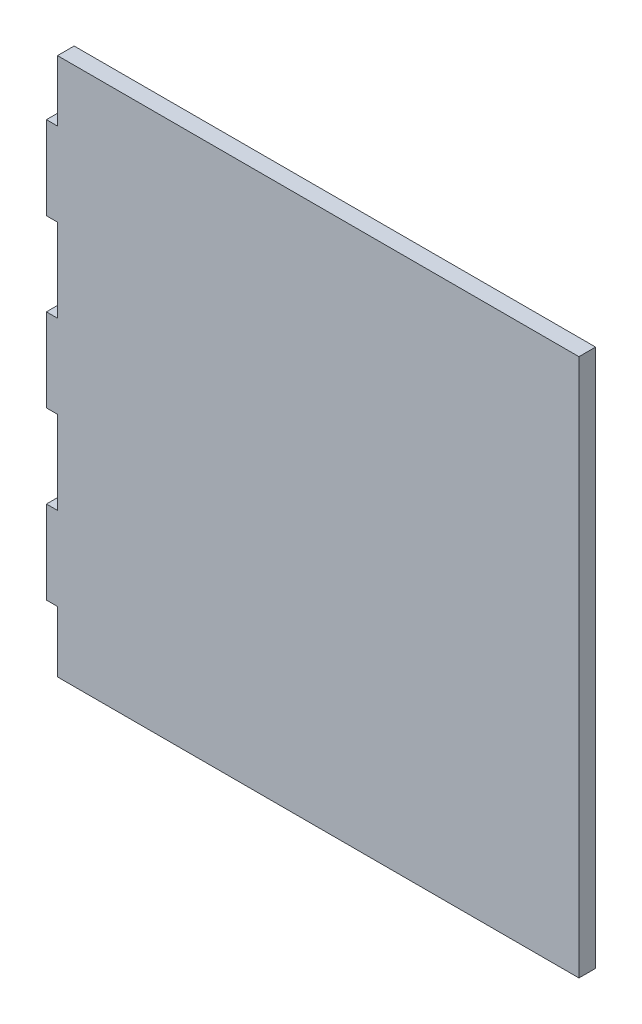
ISO-10303-21;
HEADER;
FILE_DESCRIPTION(('STEP AP214'),'2;1');
FILE_NAME('part.step','',(''),(''),'','','');
FILE_SCHEMA(('AUTOMOTIVE_DESIGN { 1 0 10303 214 1 1 1 1 }'));
ENDSEC;
DATA;
#1=APPLICATION_CONTEXT('core data for automotive mechanical design processes');
#2=APPLICATION_PROTOCOL_DEFINITION('international standard','automotive_design',2000,#1);
#3=PRODUCT_CONTEXT('',#1,'mechanical');
#4=PRODUCT('Part','Part','',(#3));
#5=PRODUCT_RELATED_PRODUCT_CATEGORY('part','',(#4));
#6=PRODUCT_DEFINITION_FORMATION('','',#4);
#7=PRODUCT_DEFINITION_CONTEXT('part definition',#1,'design');
#8=PRODUCT_DEFINITION('design','',#6,#7);
#9=PRODUCT_DEFINITION_SHAPE('','',#8);
#10=(LENGTH_UNIT() NAMED_UNIT(*) SI_UNIT(.MILLI.,.METRE.));
#11=(NAMED_UNIT(*) PLANE_ANGLE_UNIT() SI_UNIT($,.RADIAN.));
#12=(NAMED_UNIT(*) SI_UNIT($,.STERADIAN.) SOLID_ANGLE_UNIT());
#13=UNCERTAINTY_MEASURE_WITH_UNIT(LENGTH_MEASURE(1.E-05),#10,'distance_accuracy_value','');
#14=(GEOMETRIC_REPRESENTATION_CONTEXT(3) GLOBAL_UNCERTAINTY_ASSIGNED_CONTEXT((#13)) GLOBAL_UNIT_ASSIGNED_CONTEXT((#10,
#11,#12)) REPRESENTATION_CONTEXT('',''));
#15=CARTESIAN_POINT('',(0.,0.,0.));
#16=DIRECTION('',(0.,0.,1.));
#17=DIRECTION('',(1.,0.,0.));
#18=AXIS2_PLACEMENT_3D('',#15,#16,#17);
#19=CARTESIAN_POINT('',(0.,0.,6.));
#20=DIRECTION('',(1.,0.,0.));
#21=DIRECTION('',(0.,0.,-1.));
#22=AXIS2_PLACEMENT_3D('',#19,#20,#21);
#23=PLANE('',#22);
#24=DIRECTION('',(0.,0.,-1.));
#25=VECTOR('',#24,1.);
#26=CARTESIAN_POINT('',(0.,-82.,6.));
#27=LINE('',#26,#25);
#28=CARTESIAN_POINT('',(0.,-82.,6.));
#29=VERTEX_POINT('',#28);
#30=CARTESIAN_POINT('',(0.,-82.,0.));
#31=VERTEX_POINT('',#30);
#32=EDGE_CURVE('E12',#29,#31,#27,.T.);
#33=ORIENTED_EDGE('',*,*,#32,.F.);
#34=DIRECTION('',(0.,-1.,0.));
#35=VECTOR('',#34,1.);
#36=CARTESIAN_POINT('',(0.,0.,6.));
#37=LINE('',#36,#35);
#38=CARTESIAN_POINT('',(0.,-52.,6.));
#39=VERTEX_POINT('',#38);
#40=EDGE_CURVE('E232',#39,#29,#37,.T.);
#41=ORIENTED_EDGE('',*,*,#40,.F.);
#42=DIRECTION('',(0.,0.,-1.));
#43=VECTOR('',#42,1.);
#44=CARTESIAN_POINT('',(0.,-52.,6.));
#45=LINE('',#44,#43);
#46=CARTESIAN_POINT('',(0.,-52.,0.));
#47=VERTEX_POINT('',#46);
#48=EDGE_CURVE('E166',#39,#47,#45,.T.);
#49=ORIENTED_EDGE('',*,*,#48,.T.);
#50=DIRECTION('',(0.,-1.,0.));
#51=VECTOR('',#50,1.);
#52=CARTESIAN_POINT('',(0.,0.,0.));
#53=LINE('',#52,#51);
#54=EDGE_CURVE('E202',#47,#31,#53,.T.);
#55=ORIENTED_EDGE('',*,*,#54,.T.);
#56=EDGE_LOOP('',(#33,#41,#49,#55));
#57=FACE_BOUND('',#56,.T.);
#58=ADVANCED_FACE('F84',(#57),#23,.F.);
#59=CARTESIAN_POINT('',(188.,0.,6.));
#60=DIRECTION('',(1.,0.,0.));
#61=DIRECTION('',(0.,1.,0.));
#62=AXIS2_PLACEMENT_3D('',#59,#60,#61);
#63=PLANE('',#62);
#64=DIRECTION('',(0.,-1.,0.));
#65=VECTOR('',#64,1.);
#66=CARTESIAN_POINT('',(188.,0.,0.));
#67=LINE('',#66,#65);
#68=CARTESIAN_POINT('',(188.,0.,0.));
#69=VERTEX_POINT('',#68);
#70=CARTESIAN_POINT('',(188.,-194.,0.));
#71=VERTEX_POINT('',#70);
#72=EDGE_CURVE('E218',#69,#71,#67,.T.);
#73=ORIENTED_EDGE('',*,*,#72,.F.);
#74=DIRECTION('',(0.,0.,-1.));
#75=VECTOR('',#74,1.);
#76=CARTESIAN_POINT('',(188.,0.,6.));
#77=LINE('',#76,#75);
#78=CARTESIAN_POINT('',(188.,0.,6.));
#79=VERTEX_POINT('',#78);
#80=EDGE_CURVE('E151',#79,#69,#77,.T.);
#81=ORIENTED_EDGE('',*,*,#80,.F.);
#82=DIRECTION('',(0.,-1.,0.));
#83=VECTOR('',#82,1.);
#84=CARTESIAN_POINT('',(188.,0.,6.));
#85=LINE('',#84,#83);
#86=CARTESIAN_POINT('',(188.,-194.,6.));
#87=VERTEX_POINT('',#86);
#88=EDGE_CURVE('E191',#79,#87,#85,.T.);
#89=ORIENTED_EDGE('',*,*,#88,.T.);
#90=DIRECTION('',(0.,0.,-1.));
#91=VECTOR('',#90,1.);
#92=CARTESIAN_POINT('',(188.,-194.,6.));
#93=LINE('',#92,#91);
#94=EDGE_CURVE('E184',#87,#71,#93,.T.);
#95=ORIENTED_EDGE('',*,*,#94,.T.);
#96=EDGE_LOOP('',(#73,#81,#89,#95));
#97=FACE_BOUND('',#96,.T.);
#98=ADVANCED_FACE('F255',(#97),#63,.T.);
#99=CARTESIAN_POINT('',(0.,0.,6.));
#100=DIRECTION('',(0.,1.,0.));
#101=DIRECTION('',(0.,0.,1.));
#102=AXIS2_PLACEMENT_3D('',#99,#100,#101);
#103=PLANE('',#102);
#104=DIRECTION('',(1.,0.,0.));
#105=VECTOR('',#104,1.);
#106=CARTESIAN_POINT('',(0.,0.,0.));
#107=LINE('',#106,#105);
#108=CARTESIAN_POINT('',(0.,0.,0.));
#109=VERTEX_POINT('',#108);
#110=EDGE_CURVE('E215',#109,#69,#107,.T.);
#111=ORIENTED_EDGE('',*,*,#110,.F.);
#112=DIRECTION('',(0.,0.,-1.));
#113=VECTOR('',#112,1.);
#114=CARTESIAN_POINT('',(0.,0.,6.));
#115=LINE('',#114,#113);
#116=CARTESIAN_POINT('',(0.,0.,6.));
#117=VERTEX_POINT('',#116);
#118=EDGE_CURVE('E154',#117,#109,#115,.T.);
#119=ORIENTED_EDGE('',*,*,#118,.F.);
#120=DIRECTION('',(1.,0.,0.));
#121=VECTOR('',#120,1.);
#122=CARTESIAN_POINT('',(0.,0.,6.));
#123=LINE('',#122,#121);
#124=EDGE_CURVE('E246',#117,#79,#123,.T.);
#125=ORIENTED_EDGE('',*,*,#124,.T.);
#126=ORIENTED_EDGE('',*,*,#80,.T.);
#127=EDGE_LOOP('',(#111,#119,#125,#126));
#128=FACE_BOUND('',#127,.T.);
#129=ADVANCED_FACE('F272',(#128),#103,.T.);
#130=CARTESIAN_POINT('',(0.,-22.,0.));
#131=VERTEX_POINT('',#130);
#132=EDGE_CURVE('E212',#109,#131,#53,.T.);
#133=ORIENTED_EDGE('',*,*,#132,.T.);
#134=DIRECTION('',(0.,0.,-1.));
#135=VECTOR('',#134,1.);
#136=CARTESIAN_POINT('',(0.,-22.,6.));
#137=LINE('',#136,#135);
#138=CARTESIAN_POINT('',(0.,-22.,6.));
#139=VERTEX_POINT('',#138);
#140=EDGE_CURVE('E157',#139,#131,#137,.T.);
#141=ORIENTED_EDGE('',*,*,#140,.F.);
#142=EDGE_CURVE('E243',#117,#139,#37,.T.);
#143=ORIENTED_EDGE('',*,*,#142,.F.);
#144=ORIENTED_EDGE('',*,*,#118,.T.);
#145=EDGE_LOOP('',(#133,#141,#143,#144));
#146=FACE_BOUND('',#145,.T.);
#147=ADVANCED_FACE('F280',(#146),#23,.F.);
#148=CARTESIAN_POINT('',(0.,-22.,6.));
#149=DIRECTION('',(0.,-1.,0.));
#150=DIRECTION('',(0.,0.,-1.));
#151=AXIS2_PLACEMENT_3D('',#148,#149,#150);
#152=PLANE('',#151);
#153=DIRECTION('',(-1.,0.,0.));
#154=VECTOR('',#153,1.);
#155=CARTESIAN_POINT('',(0.,-22.,0.));
#156=LINE('',#155,#154);
#157=CARTESIAN_POINT('',(-4.,-22.,0.));
#158=VERTEX_POINT('',#157);
#159=EDGE_CURVE('E209',#131,#158,#156,.T.);
#160=ORIENTED_EDGE('',*,*,#159,.T.);
#161=DIRECTION('',(0.,0.,-1.));
#162=VECTOR('',#161,1.);
#163=CARTESIAN_POINT('',(-4.,-22.,6.));
#164=LINE('',#163,#162);
#165=CARTESIAN_POINT('',(-4.,-22.,6.));
#166=VERTEX_POINT('',#165);
#167=EDGE_CURVE('E160',#166,#158,#164,.T.);
#168=ORIENTED_EDGE('',*,*,#167,.F.);
#169=DIRECTION('',(-1.,0.,0.));
#170=VECTOR('',#169,1.);
#171=CARTESIAN_POINT('',(0.,-22.,6.));
#172=LINE('',#171,#170);
#173=EDGE_CURVE('E240',#139,#166,#172,.T.);
#174=ORIENTED_EDGE('',*,*,#173,.F.);
#175=ORIENTED_EDGE('',*,*,#140,.T.);
#176=EDGE_LOOP('',(#160,#168,#174,#175));
#177=FACE_BOUND('',#176,.T.);
#178=ADVANCED_FACE('F343',(#177),#152,.F.);
#179=CARTESIAN_POINT('',(-4.,0.,6.));
#180=DIRECTION('',(1.,0.,0.));
#181=DIRECTION('',(0.,0.,-1.));
#182=AXIS2_PLACEMENT_3D('',#179,#180,#181);
#183=PLANE('',#182);
#184=DIRECTION('',(0.,-1.,0.));
#185=VECTOR('',#184,1.);
#186=CARTESIAN_POINT('',(-4.,0.,0.));
#187=LINE('',#186,#185);
#188=CARTESIAN_POINT('',(-4.,-52.,0.));
#189=VERTEX_POINT('',#188);
#190=EDGE_CURVE('E206',#158,#189,#187,.T.);
#191=ORIENTED_EDGE('',*,*,#190,.T.);
#192=DIRECTION('',(0.,0.,-1.));
#193=VECTOR('',#192,1.);
#194=CARTESIAN_POINT('',(-4.,-52.,6.));
#195=LINE('',#194,#193);
#196=CARTESIAN_POINT('',(-4.,-52.,6.));
#197=VERTEX_POINT('',#196);
#198=EDGE_CURVE('E163',#197,#189,#195,.T.);
#199=ORIENTED_EDGE('',*,*,#198,.F.);
#200=DIRECTION('',(0.,-1.,0.));
#201=VECTOR('',#200,1.);
#202=CARTESIAN_POINT('',(-4.,0.,6.));
#203=LINE('',#202,#201);
#204=EDGE_CURVE('E237',#166,#197,#203,.T.);
#205=ORIENTED_EDGE('',*,*,#204,.F.);
#206=ORIENTED_EDGE('',*,*,#167,.T.);
#207=EDGE_LOOP('',(#191,#199,#205,#206));
#208=FACE_BOUND('',#207,.T.);
#209=ADVANCED_FACE('F347',(#208),#183,.F.);
#210=CARTESIAN_POINT('',(0.,-52.,6.));
#211=DIRECTION('',(0.,-1.,0.));
#212=DIRECTION('',(0.,0.,-1.));
#213=AXIS2_PLACEMENT_3D('',#210,#211,#212);
#214=PLANE('',#213);
#215=DIRECTION('',(-1.,0.,0.));
#216=VECTOR('',#215,1.);
#217=CARTESIAN_POINT('',(0.,-52.,0.));
#218=LINE('',#217,#216);
#219=EDGE_CURVE('E203',#47,#189,#218,.T.);
#220=ORIENTED_EDGE('',*,*,#219,.F.);
#221=ORIENTED_EDGE('',*,*,#48,.F.);
#222=DIRECTION('',(-1.,0.,0.));
#223=VECTOR('',#222,1.);
#224=CARTESIAN_POINT('',(0.,-52.,6.));
#225=LINE('',#224,#223);
#226=EDGE_CURVE('E233',#39,#197,#225,.T.);
#227=ORIENTED_EDGE('',*,*,#226,.T.);
#228=ORIENTED_EDGE('',*,*,#198,.T.);
#229=EDGE_LOOP('',(#220,#221,#227,#228));
#230=FACE_BOUND('',#229,.T.);
#231=ADVANCED_FACE('F352',(#230),#214,.T.);
#232=CARTESIAN_POINT('',(0.,-112.,6.));
#233=VERTEX_POINT('',#232);
#234=CARTESIAN_POINT('',(0.,-142.,6.));
#235=VERTEX_POINT('',#234);
#236=EDGE_CURVE('E236',#233,#235,#37,.T.);
#237=ORIENTED_EDGE('',*,*,#236,.F.);
#238=DIRECTION('',(0.,0.,-1.));
#239=VECTOR('',#238,1.);
#240=CARTESIAN_POINT('',(0.,-112.,6.));
#241=LINE('',#240,#239);
#242=CARTESIAN_POINT('',(0.,-112.,0.));
#243=VERTEX_POINT('',#242);
#244=EDGE_CURVE('E94',#233,#243,#241,.T.);
#245=ORIENTED_EDGE('',*,*,#244,.T.);
#246=CARTESIAN_POINT('',(0.,-142.,0.));
#247=VERTEX_POINT('',#246);
#248=EDGE_CURVE('E140',#243,#247,#53,.T.);
#249=ORIENTED_EDGE('',*,*,#248,.T.);
#250=DIRECTION('',(0.,0.,-1.));
#251=VECTOR('',#250,1.);
#252=CARTESIAN_POINT('',(0.,-142.,6.));
#253=LINE('',#252,#251);
#254=EDGE_CURVE('E169',#235,#247,#253,.T.);
#255=ORIENTED_EDGE('',*,*,#254,.F.);
#256=EDGE_LOOP('',(#237,#245,#249,#255));
#257=FACE_BOUND('',#256,.T.);
#258=ADVANCED_FACE('F327',(#257),#23,.F.);
#259=CARTESIAN_POINT('',(0.,-142.,6.));
#260=DIRECTION('',(0.,-1.,0.));
#261=DIRECTION('',(0.,0.,-1.));
#262=AXIS2_PLACEMENT_3D('',#259,#260,#261);
#263=PLANE('',#262);
#264=DIRECTION('',(-1.,0.,0.));
#265=VECTOR('',#264,1.);
#266=CARTESIAN_POINT('',(0.,-142.,0.));
#267=LINE('',#266,#265);
#268=CARTESIAN_POINT('',(-4.,-142.,0.));
#269=VERTEX_POINT('',#268);
#270=EDGE_CURVE('E199',#247,#269,#267,.T.);
#271=ORIENTED_EDGE('',*,*,#270,.T.);
#272=DIRECTION('',(0.,0.,-1.));
#273=VECTOR('',#272,1.);
#274=CARTESIAN_POINT('',(-4.,-142.,6.));
#275=LINE('',#274,#273);
#276=CARTESIAN_POINT('',(-4.,-142.,6.));
#277=VERTEX_POINT('',#276);
#278=EDGE_CURVE('E172',#277,#269,#275,.T.);
#279=ORIENTED_EDGE('',*,*,#278,.F.);
#280=DIRECTION('',(-1.,0.,0.));
#281=VECTOR('',#280,1.);
#282=CARTESIAN_POINT('',(0.,-142.,6.));
#283=LINE('',#282,#281);
#284=EDGE_CURVE('E229',#235,#277,#283,.T.);
#285=ORIENTED_EDGE('',*,*,#284,.F.);
#286=ORIENTED_EDGE('',*,*,#254,.T.);
#287=EDGE_LOOP('',(#271,#279,#285,#286));
#288=FACE_BOUND('',#287,.T.);
#289=ADVANCED_FACE('F379',(#288),#263,.F.);
#290=CARTESIAN_POINT('',(-4.,0.,6.));
#291=DIRECTION('',(1.,0.,0.));
#292=DIRECTION('',(0.,0.,-1.));
#293=AXIS2_PLACEMENT_3D('',#290,#291,#292);
#294=PLANE('',#293);
#295=DIRECTION('',(0.,-1.,0.));
#296=VECTOR('',#295,1.);
#297=CARTESIAN_POINT('',(-4.,0.,0.));
#298=LINE('',#297,#296);
#299=CARTESIAN_POINT('',(-4.,-172.,0.));
#300=VERTEX_POINT('',#299);
#301=EDGE_CURVE('E196',#269,#300,#298,.T.);
#302=ORIENTED_EDGE('',*,*,#301,.T.);
#303=DIRECTION('',(0.,0.,-1.));
#304=VECTOR('',#303,1.);
#305=CARTESIAN_POINT('',(-4.,-172.,6.));
#306=LINE('',#305,#304);
#307=CARTESIAN_POINT('',(-4.,-172.,6.));
#308=VERTEX_POINT('',#307);
#309=EDGE_CURVE('E175',#308,#300,#306,.T.);
#310=ORIENTED_EDGE('',*,*,#309,.F.);
#311=DIRECTION('',(0.,-1.,0.));
#312=VECTOR('',#311,1.);
#313=CARTESIAN_POINT('',(-4.,0.,6.));
#314=LINE('',#313,#312);
#315=EDGE_CURVE('E226',#277,#308,#314,.T.);
#316=ORIENTED_EDGE('',*,*,#315,.F.);
#317=ORIENTED_EDGE('',*,*,#278,.T.);
#318=EDGE_LOOP('',(#302,#310,#316,#317));
#319=FACE_BOUND('',#318,.T.);
#320=ADVANCED_FACE('F382',(#319),#294,.F.);
#321=CARTESIAN_POINT('',(0.,-172.,6.));
#322=DIRECTION('',(0.,-1.,0.));
#323=DIRECTION('',(0.,0.,-1.));
#324=AXIS2_PLACEMENT_3D('',#321,#322,#323);
#325=PLANE('',#324);
#326=DIRECTION('',(-1.,0.,0.));
#327=VECTOR('',#326,1.);
#328=CARTESIAN_POINT('',(0.,-172.,0.));
#329=LINE('',#328,#327);
#330=CARTESIAN_POINT('',(0.,-172.,0.));
#331=VERTEX_POINT('',#330);
#332=EDGE_CURVE('E193',#331,#300,#329,.T.);
#333=ORIENTED_EDGE('',*,*,#332,.F.);
#334=DIRECTION('',(0.,0.,-1.));
#335=VECTOR('',#334,1.);
#336=CARTESIAN_POINT('',(0.,-172.,6.));
#337=LINE('',#336,#335);
#338=CARTESIAN_POINT('',(0.,-172.,6.));
#339=VERTEX_POINT('',#338);
#340=EDGE_CURVE('E178',#339,#331,#337,.T.);
#341=ORIENTED_EDGE('',*,*,#340,.F.);
#342=DIRECTION('',(-1.,0.,0.));
#343=VECTOR('',#342,1.);
#344=CARTESIAN_POINT('',(0.,-172.,6.));
#345=LINE('',#344,#343);
#346=EDGE_CURVE('E223',#339,#308,#345,.T.);
#347=ORIENTED_EDGE('',*,*,#346,.T.);
#348=ORIENTED_EDGE('',*,*,#309,.T.);
#349=EDGE_LOOP('',(#333,#341,#347,#348));
#350=FACE_BOUND('',#349,.T.);
#351=ADVANCED_FACE('F386',(#350),#325,.T.);
#352=CARTESIAN_POINT('',(0.,-194.,0.));
#353=VERTEX_POINT('',#352);
#354=EDGE_CURVE('E192',#331,#353,#53,.T.);
#355=ORIENTED_EDGE('',*,*,#354,.T.);
#356=DIRECTION('',(0.,0.,-1.));
#357=VECTOR('',#356,1.);
#358=CARTESIAN_POINT('',(0.,-194.,6.));
#359=LINE('',#358,#357);
#360=CARTESIAN_POINT('',(0.,-194.,6.));
#361=VERTEX_POINT('',#360);
#362=EDGE_CURVE('E181',#361,#353,#359,.T.);
#363=ORIENTED_EDGE('',*,*,#362,.F.);
#364=EDGE_CURVE('E222',#339,#361,#37,.T.);
#365=ORIENTED_EDGE('',*,*,#364,.F.);
#366=ORIENTED_EDGE('',*,*,#340,.T.);
#367=EDGE_LOOP('',(#355,#363,#365,#366));
#368=FACE_BOUND('',#367,.T.);
#369=ADVANCED_FACE('F335',(#368),#23,.F.);
#370=CARTESIAN_POINT('',(0.,-194.,6.));
#371=DIRECTION('',(0.,1.,0.));
#372=DIRECTION('',(0.,0.,1.));
#373=AXIS2_PLACEMENT_3D('',#370,#371,#372);
#374=PLANE('',#373);
#375=DIRECTION('',(1.,0.,0.));
#376=VECTOR('',#375,1.);
#377=CARTESIAN_POINT('',(0.,-194.,0.));
#378=LINE('',#377,#376);
#379=EDGE_CURVE('E188',#353,#71,#378,.T.);
#380=ORIENTED_EDGE('',*,*,#379,.T.);
#381=ORIENTED_EDGE('',*,*,#94,.F.);
#382=DIRECTION('',(1.,0.,0.));
#383=VECTOR('',#382,1.);
#384=CARTESIAN_POINT('',(0.,-194.,6.));
#385=LINE('',#384,#383);
#386=EDGE_CURVE('E187',#361,#87,#385,.T.);
#387=ORIENTED_EDGE('',*,*,#386,.F.);
#388=ORIENTED_EDGE('',*,*,#362,.T.);
#389=EDGE_LOOP('',(#380,#381,#387,#388));
#390=FACE_BOUND('',#389,.T.);
#391=ADVANCED_FACE('F339',(#390),#374,.F.);
#392=CARTESIAN_POINT('',(0.,0.,6.));
#393=DIRECTION('',(0.,0.,1.));
#394=DIRECTION('',(1.,0.,0.));
#395=AXIS2_PLACEMENT_3D('',#392,#393,#394);
#396=PLANE('',#395);
#397=ORIENTED_EDGE('',*,*,#88,.F.);
#398=ORIENTED_EDGE('',*,*,#124,.F.);
#399=ORIENTED_EDGE('',*,*,#142,.T.);
#400=ORIENTED_EDGE('',*,*,#173,.T.);
#401=ORIENTED_EDGE('',*,*,#204,.T.);
#402=ORIENTED_EDGE('',*,*,#226,.F.);
#403=ORIENTED_EDGE('',*,*,#40,.T.);
#404=DIRECTION('',(-1.,0.,0.));
#405=VECTOR('',#404,1.);
#406=CARTESIAN_POINT('',(0.,-82.,6.));
#407=LINE('',#406,#405);
#408=CARTESIAN_POINT('',(-4.,-82.,6.));
#409=VERTEX_POINT('',#408);
#410=EDGE_CURVE('E141',#29,#409,#407,.T.);
#411=ORIENTED_EDGE('',*,*,#410,.T.);
#412=DIRECTION('',(0.,-1.,0.));
#413=VECTOR('',#412,1.);
#414=CARTESIAN_POINT('',(-4.,-82.,6.));
#415=LINE('',#414,#413);
#416=CARTESIAN_POINT('',(-4.,-112.,6.));
#417=VERTEX_POINT('',#416);
#418=EDGE_CURVE('E144',#409,#417,#415,.T.);
#419=ORIENTED_EDGE('',*,*,#418,.T.);
#420=DIRECTION('',(-1.,0.,0.));
#421=VECTOR('',#420,1.);
#422=CARTESIAN_POINT('',(0.,-112.,6.));
#423=LINE('',#422,#421);
#424=EDGE_CURVE('E129',#233,#417,#423,.T.);
#425=ORIENTED_EDGE('',*,*,#424,.F.);
#426=ORIENTED_EDGE('',*,*,#236,.T.);
#427=ORIENTED_EDGE('',*,*,#284,.T.);
#428=ORIENTED_EDGE('',*,*,#315,.T.);
#429=ORIENTED_EDGE('',*,*,#346,.F.);
#430=ORIENTED_EDGE('',*,*,#364,.T.);
#431=ORIENTED_EDGE('',*,*,#386,.T.);
#432=EDGE_LOOP('',(#397,#398,#399,#400,#401,#402,#403,#411,#419,#425,#426,#427,#428,#429,#430,#431));
#433=FACE_BOUND('',#432,.T.);
#434=ADVANCED_FACE('F264',(#433),#396,.T.);
#435=CARTESIAN_POINT('',(0.,0.,0.));
#436=DIRECTION('',(0.,0.,1.));
#437=DIRECTION('',(1.,0.,0.));
#438=AXIS2_PLACEMENT_3D('',#435,#436,#437);
#439=PLANE('',#438);
#440=ORIENTED_EDGE('',*,*,#72,.T.);
#441=ORIENTED_EDGE('',*,*,#379,.F.);
#442=ORIENTED_EDGE('',*,*,#354,.F.);
#443=ORIENTED_EDGE('',*,*,#332,.T.);
#444=ORIENTED_EDGE('',*,*,#301,.F.);
#445=ORIENTED_EDGE('',*,*,#270,.F.);
#446=ORIENTED_EDGE('',*,*,#248,.F.);
#447=DIRECTION('',(-1.,0.,0.));
#448=VECTOR('',#447,1.);
#449=CARTESIAN_POINT('',(0.,-112.,0.));
#450=LINE('',#449,#448);
#451=CARTESIAN_POINT('',(-4.,-112.,0.));
#452=VERTEX_POINT('',#451);
#453=EDGE_CURVE('E127',#243,#452,#450,.T.);
#454=ORIENTED_EDGE('',*,*,#453,.T.);
#455=DIRECTION('',(0.,-1.,0.));
#456=VECTOR('',#455,1.);
#457=CARTESIAN_POINT('',(-4.,-82.,0.));
#458=LINE('',#457,#456);
#459=CARTESIAN_POINT('',(-4.,-82.,0.));
#460=VERTEX_POINT('',#459);
#461=EDGE_CURVE('E121',#460,#452,#458,.T.);
#462=ORIENTED_EDGE('',*,*,#461,.F.);
#463=DIRECTION('',(-1.,0.,0.));
#464=VECTOR('',#463,1.);
#465=CARTESIAN_POINT('',(0.,-82.,0.));
#466=LINE('',#465,#464);
#467=EDGE_CURVE('E134',#31,#460,#466,.T.);
#468=ORIENTED_EDGE('',*,*,#467,.F.);
#469=ORIENTED_EDGE('',*,*,#54,.F.);
#470=ORIENTED_EDGE('',*,*,#219,.T.);
#471=ORIENTED_EDGE('',*,*,#190,.F.);
#472=ORIENTED_EDGE('',*,*,#159,.F.);
#473=ORIENTED_EDGE('',*,*,#132,.F.);
#474=ORIENTED_EDGE('',*,*,#110,.T.);
#475=EDGE_LOOP('',(#440,#441,#442,#443,#444,#445,#446,#454,#462,#468,#469,#470,#471,#472,#473,#474));
#476=FACE_BOUND('',#475,.T.);
#477=ADVANCED_FACE('F137',(#476),#439,.F.);
#478=CARTESIAN_POINT('',(-4.,-82.,6.));
#479=DIRECTION('',(1.,0.,0.));
#480=DIRECTION('',(0.,0.,-1.));
#481=AXIS2_PLACEMENT_3D('',#478,#479,#480);
#482=PLANE('',#481);
#483=ORIENTED_EDGE('',*,*,#461,.T.);
#484=DIRECTION('',(0.,0.,-1.));
#485=VECTOR('',#484,1.);
#486=CARTESIAN_POINT('',(-4.,-112.,6.));
#487=LINE('',#486,#485);
#488=EDGE_CURVE('E125',#417,#452,#487,.T.);
#489=ORIENTED_EDGE('',*,*,#488,.F.);
#490=ORIENTED_EDGE('',*,*,#418,.F.);
#491=DIRECTION('',(0.,0.,-1.));
#492=VECTOR('',#491,1.);
#493=CARTESIAN_POINT('',(-4.,-82.,6.));
#494=LINE('',#493,#492);
#495=EDGE_CURVE('E88',#409,#460,#494,.T.);
#496=ORIENTED_EDGE('',*,*,#495,.T.);
#497=EDGE_LOOP('',(#483,#489,#490,#496));
#498=FACE_BOUND('',#497,.T.);
#499=ADVANCED_FACE('F131',(#498),#482,.F.);
#500=CARTESIAN_POINT('',(0.,-112.,6.));
#501=DIRECTION('',(0.,-1.,0.));
#502=DIRECTION('',(0.,0.,-1.));
#503=AXIS2_PLACEMENT_3D('',#500,#501,#502);
#504=PLANE('',#503);
#505=ORIENTED_EDGE('',*,*,#453,.F.);
#506=ORIENTED_EDGE('',*,*,#244,.F.);
#507=ORIENTED_EDGE('',*,*,#424,.T.);
#508=ORIENTED_EDGE('',*,*,#488,.T.);
#509=EDGE_LOOP('',(#505,#506,#507,#508));
#510=FACE_BOUND('',#509,.T.);
#511=ADVANCED_FACE('F126',(#510),#504,.T.);
#512=CARTESIAN_POINT('',(0.,-82.,6.));
#513=DIRECTION('',(0.,-1.,0.));
#514=DIRECTION('',(0.,0.,-1.));
#515=AXIS2_PLACEMENT_3D('',#512,#513,#514);
#516=PLANE('',#515);
#517=ORIENTED_EDGE('',*,*,#467,.T.);
#518=ORIENTED_EDGE('',*,*,#495,.F.);
#519=ORIENTED_EDGE('',*,*,#410,.F.);
#520=ORIENTED_EDGE('',*,*,#32,.T.);
#521=EDGE_LOOP('',(#517,#518,#519,#520));
#522=FACE_BOUND('',#521,.T.);
#523=ADVANCED_FACE('F86',(#522),#516,.F.);
#524=CLOSED_SHELL('',(#58,#98,#129,#147,#178,#209,#231,#258,#289,#320,#351,#369,#391,#434,#477,
#499,#511,#523));
#525=MANIFOLD_SOLID_BREP('B2',#524);
#526=ADVANCED_BREP_SHAPE_REPRESENTATION('',(#18,#525),#14);
#527=SHAPE_DEFINITION_REPRESENTATION(#9,#526);
ENDSEC;
END-ISO-10303-21;
